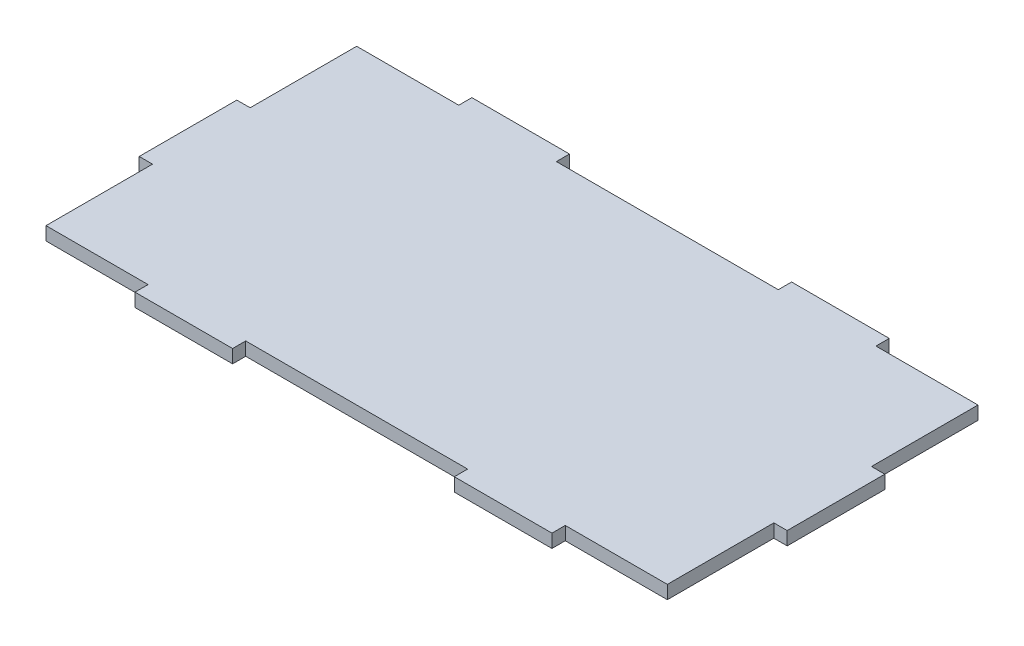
ISO-10303-21;
HEADER;
FILE_DESCRIPTION(('STEP AP214'),'2;1');
FILE_NAME('part.step','',(''),(''),'','','');
FILE_SCHEMA(('AUTOMOTIVE_DESIGN { 1 0 10303 214 1 1 1 1 }'));
ENDSEC;
DATA;
#1=APPLICATION_CONTEXT('core data for automotive mechanical design processes');
#2=APPLICATION_PROTOCOL_DEFINITION('international standard','automotive_design',2000,#1);
#3=PRODUCT_CONTEXT('',#1,'mechanical');
#4=PRODUCT('Part','Part','',(#3));
#5=PRODUCT_RELATED_PRODUCT_CATEGORY('part','',(#4));
#6=PRODUCT_DEFINITION_FORMATION('','',#4);
#7=PRODUCT_DEFINITION_CONTEXT('part definition',#1,'design');
#8=PRODUCT_DEFINITION('design','',#6,#7);
#9=PRODUCT_DEFINITION_SHAPE('','',#8);
#10=(LENGTH_UNIT() NAMED_UNIT(*) SI_UNIT(.MILLI.,.METRE.));
#11=(NAMED_UNIT(*) PLANE_ANGLE_UNIT() SI_UNIT($,.RADIAN.));
#12=(NAMED_UNIT(*) SI_UNIT($,.STERADIAN.) SOLID_ANGLE_UNIT());
#13=UNCERTAINTY_MEASURE_WITH_UNIT(LENGTH_MEASURE(1.E-05),#10,'distance_accuracy_value','');
#14=(GEOMETRIC_REPRESENTATION_CONTEXT(3) GLOBAL_UNCERTAINTY_ASSIGNED_CONTEXT((#13)) GLOBAL_UNIT_ASSIGNED_CONTEXT((#10,
#11,#12)) REPRESENTATION_CONTEXT('',''));
#15=CARTESIAN_POINT('',(0.,0.,0.));
#16=DIRECTION('',(0.,0.,1.));
#17=DIRECTION('',(1.,0.,0.));
#18=AXIS2_PLACEMENT_3D('',#15,#16,#17);
#19=CARTESIAN_POINT('',(0.,3.,-35.9354419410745));
#20=DIRECTION('',(0.,0.,-1.));
#21=DIRECTION('',(-1.,0.,0.));
#22=AXIS2_PLACEMENT_3D('',#19,#20,#21);
#23=PLANE('',#22);
#24=DIRECTION('',(1.,0.,0.));
#25=VECTOR('',#24,1.);
#26=CARTESIAN_POINT('',(0.,0.,-35.9354419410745));
#27=LINE('',#26,#25);
#28=CARTESIAN_POINT('',(-24.1954262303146,0.,-35.9354419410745));
#29=VERTEX_POINT('',#28);
#30=CARTESIAN_POINT('',(25.8045737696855,0.,-35.9354419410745));
#31=VERTEX_POINT('',#30);
#32=EDGE_CURVE('E249',#29,#31,#27,.T.);
#33=ORIENTED_EDGE('',*,*,#32,.F.);
#34=DIRECTION('',(0.,-1.,0.));
#35=VECTOR('',#34,1.);
#36=CARTESIAN_POINT('',(-24.1954262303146,3.,-35.9354419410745));
#37=LINE('',#36,#35);
#38=CARTESIAN_POINT('',(-24.1954262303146,3.,-35.9354419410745));
#39=VERTEX_POINT('',#38);
#40=EDGE_CURVE('E11',#39,#29,#37,.T.);
#41=ORIENTED_EDGE('',*,*,#40,.F.);
#42=DIRECTION('',(1.,0.,0.));
#43=VECTOR('',#42,1.);
#44=CARTESIAN_POINT('',(0.,3.,-35.9354419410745));
#45=LINE('',#44,#43);
#46=CARTESIAN_POINT('',(25.8045737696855,3.,-35.9354419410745));
#47=VERTEX_POINT('',#46);
#48=EDGE_CURVE('E322',#39,#47,#45,.T.);
#49=ORIENTED_EDGE('',*,*,#48,.T.);
#50=DIRECTION('',(0.,-1.,0.));
#51=VECTOR('',#50,1.);
#52=CARTESIAN_POINT('',(25.8045737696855,3.,-35.9354419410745));
#53=LINE('',#52,#51);
#54=EDGE_CURVE('E51',#47,#31,#53,.T.);
#55=ORIENTED_EDGE('',*,*,#54,.T.);
#56=EDGE_LOOP('',(#33,#41,#49,#55));
#57=FACE_BOUND('',#56,.T.);
#58=ADVANCED_FACE('F35',(#57),#23,.T.);
#59=CARTESIAN_POINT('',(-24.1954262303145,3.,0.));
#60=DIRECTION('',(-1.,0.,0.));
#61=DIRECTION('',(0.,0.,1.));
#62=AXIS2_PLACEMENT_3D('',#59,#60,#61);
#63=PLANE('',#62);
#64=DIRECTION('',(0.,0.,-1.));
#65=VECTOR('',#64,1.);
#66=CARTESIAN_POINT('',(-24.1954262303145,0.,0.));
#67=LINE('',#66,#65);
#68=CARTESIAN_POINT('',(-24.1954262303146,0.,-38.8906545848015));
#69=VERTEX_POINT('',#68);
#70=EDGE_CURVE('E251',#29,#69,#67,.T.);
#71=ORIENTED_EDGE('',*,*,#70,.T.);
#72=DIRECTION('',(0.,-1.,0.));
#73=VECTOR('',#72,1.);
#74=CARTESIAN_POINT('',(-24.1954262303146,3.,-38.8906545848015));
#75=LINE('',#74,#73);
#76=CARTESIAN_POINT('',(-24.1954262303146,3.,-38.8906545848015));
#77=VERTEX_POINT('',#76);
#78=EDGE_CURVE('E43',#77,#69,#75,.T.);
#79=ORIENTED_EDGE('',*,*,#78,.F.);
#80=DIRECTION('',(0.,0.,-1.));
#81=VECTOR('',#80,1.);
#82=CARTESIAN_POINT('',(-24.1954262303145,3.,0.));
#83=LINE('',#82,#81);
#84=EDGE_CURVE('E398',#39,#77,#83,.T.);
#85=ORIENTED_EDGE('',*,*,#84,.F.);
#86=ORIENTED_EDGE('',*,*,#40,.T.);
#87=EDGE_LOOP('',(#71,#79,#85,#86));
#88=FACE_BOUND('',#87,.T.);
#89=ADVANCED_FACE('F385',(#88),#63,.F.);
#90=CARTESIAN_POINT('',(0.,3.,-38.8906545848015));
#91=DIRECTION('',(0.,0.,-1.));
#92=DIRECTION('',(-1.,0.,0.));
#93=AXIS2_PLACEMENT_3D('',#90,#91,#92);
#94=PLANE('',#93);
#95=DIRECTION('',(1.,0.,0.));
#96=VECTOR('',#95,1.);
#97=CARTESIAN_POINT('',(0.,0.,-38.8906545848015));
#98=LINE('',#97,#96);
#99=CARTESIAN_POINT('',(-46.1954262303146,0.,-38.8906545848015));
#100=VERTEX_POINT('',#99);
#101=EDGE_CURVE('E254',#100,#69,#98,.T.);
#102=ORIENTED_EDGE('',*,*,#101,.F.);
#103=DIRECTION('',(0.,-1.,0.));
#104=VECTOR('',#103,1.);
#105=CARTESIAN_POINT('',(-46.1954262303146,3.,-38.8906545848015));
#106=LINE('',#105,#104);
#107=CARTESIAN_POINT('',(-46.1954262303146,3.,-38.8906545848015));
#108=VERTEX_POINT('',#107);
#109=EDGE_CURVE('E375',#108,#100,#106,.T.);
#110=ORIENTED_EDGE('',*,*,#109,.F.);
#111=DIRECTION('',(1.,0.,0.));
#112=VECTOR('',#111,1.);
#113=CARTESIAN_POINT('',(0.,3.,-38.8906545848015));
#114=LINE('',#113,#112);
#115=EDGE_CURVE('E382',#108,#77,#114,.T.);
#116=ORIENTED_EDGE('',*,*,#115,.T.);
#117=ORIENTED_EDGE('',*,*,#78,.T.);
#118=EDGE_LOOP('',(#102,#110,#116,#117));
#119=FACE_BOUND('',#118,.T.);
#120=ADVANCED_FACE('F380',(#119),#94,.T.);
#121=CARTESIAN_POINT('',(-46.1954262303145,3.,1.06848387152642E-13));
#122=DIRECTION('',(-1.,0.,0.));
#123=DIRECTION('',(0.,0.,1.));
#124=AXIS2_PLACEMENT_3D('',#121,#122,#123);
#125=PLANE('',#124);
#126=DIRECTION('',(0.,0.,-1.));
#127=VECTOR('',#126,1.);
#128=CARTESIAN_POINT('',(-46.1954262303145,0.,1.06848387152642E-13));
#129=LINE('',#128,#127);
#130=CARTESIAN_POINT('',(-46.1954262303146,0.,-35.9354419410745));
#131=VERTEX_POINT('',#130);
#132=EDGE_CURVE('E257',#131,#100,#129,.T.);
#133=ORIENTED_EDGE('',*,*,#132,.F.);
#134=DIRECTION('',(0.,-1.,0.));
#135=VECTOR('',#134,1.);
#136=CARTESIAN_POINT('',(-46.1954262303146,3.,-35.9354419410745));
#137=LINE('',#136,#135);
#138=CARTESIAN_POINT('',(-46.1954262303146,3.,-35.9354419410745));
#139=VERTEX_POINT('',#138);
#140=EDGE_CURVE('E373',#139,#131,#137,.T.);
#141=ORIENTED_EDGE('',*,*,#140,.F.);
#142=DIRECTION('',(0.,0.,-1.));
#143=VECTOR('',#142,1.);
#144=CARTESIAN_POINT('',(-46.1954262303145,3.,1.06848387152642E-13));
#145=LINE('',#144,#143);
#146=EDGE_CURVE('E395',#139,#108,#145,.T.);
#147=ORIENTED_EDGE('',*,*,#146,.T.);
#148=ORIENTED_EDGE('',*,*,#109,.T.);
#149=EDGE_LOOP('',(#133,#141,#147,#148));
#150=FACE_BOUND('',#149,.T.);
#151=ADVANCED_FACE('F392',(#150),#125,.T.);
#152=CARTESIAN_POINT('',(0.,3.,-35.9354419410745));
#153=DIRECTION('',(0.,0.,-1.));
#154=DIRECTION('',(-1.,0.,0.));
#155=AXIS2_PLACEMENT_3D('',#152,#153,#154);
#156=PLANE('',#155);
#157=DIRECTION('',(1.,0.,0.));
#158=VECTOR('',#157,1.);
#159=CARTESIAN_POINT('',(0.,0.,-35.9354419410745));
#160=LINE('',#159,#158);
#161=CARTESIAN_POINT('',(-69.1954262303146,0.,-35.9354419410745));
#162=VERTEX_POINT('',#161);
#163=EDGE_CURVE('E260',#162,#131,#160,.T.);
#164=ORIENTED_EDGE('',*,*,#163,.F.);
#165=DIRECTION('',(0.,-1.,0.));
#166=VECTOR('',#165,1.);
#167=CARTESIAN_POINT('',(-69.1954262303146,3.,-35.9354419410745));
#168=LINE('',#167,#166);
#169=CARTESIAN_POINT('',(-69.1954262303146,3.,-35.9354419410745));
#170=VERTEX_POINT('',#169);
#171=EDGE_CURVE('E371',#170,#162,#168,.T.);
#172=ORIENTED_EDGE('',*,*,#171,.F.);
#173=DIRECTION('',(1.,0.,0.));
#174=VECTOR('',#173,1.);
#175=CARTESIAN_POINT('',(0.,3.,-35.9354419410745));
#176=LINE('',#175,#174);
#177=EDGE_CURVE('E400',#170,#139,#176,.T.);
#178=ORIENTED_EDGE('',*,*,#177,.T.);
#179=ORIENTED_EDGE('',*,*,#140,.T.);
#180=EDGE_LOOP('',(#164,#172,#178,#179));
#181=FACE_BOUND('',#180,.T.);
#182=ADVANCED_FACE('F475',(#181),#156,.T.);
#183=CARTESIAN_POINT('',(-69.1954262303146,3.,0.));
#184=DIRECTION('',(1.,0.,0.));
#185=DIRECTION('',(0.,0.,-1.));
#186=AXIS2_PLACEMENT_3D('',#183,#184,#185);
#187=PLANE('',#186);
#188=DIRECTION('',(0.,0.,1.));
#189=VECTOR('',#188,1.);
#190=CARTESIAN_POINT('',(-69.1954262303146,0.,0.));
#191=LINE('',#190,#189);
#192=CARTESIAN_POINT('',(-69.1954262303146,0.,-11.9354419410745));
#193=VERTEX_POINT('',#192);
#194=EDGE_CURVE('E263',#162,#193,#191,.T.);
#195=ORIENTED_EDGE('',*,*,#194,.T.);
#196=DIRECTION('',(0.,-1.,0.));
#197=VECTOR('',#196,1.);
#198=CARTESIAN_POINT('',(-69.1954262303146,3.,-11.9354419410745));
#199=LINE('',#198,#197);
#200=CARTESIAN_POINT('',(-69.1954262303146,3.,-11.9354419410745));
#201=VERTEX_POINT('',#200);
#202=EDGE_CURVE('E368',#201,#193,#199,.T.);
#203=ORIENTED_EDGE('',*,*,#202,.F.);
#204=DIRECTION('',(0.,0.,1.));
#205=VECTOR('',#204,1.);
#206=CARTESIAN_POINT('',(-69.1954262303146,3.,0.));
#207=LINE('',#206,#205);
#208=EDGE_CURVE('E406',#170,#201,#207,.T.);
#209=ORIENTED_EDGE('',*,*,#208,.F.);
#210=ORIENTED_EDGE('',*,*,#171,.T.);
#211=EDGE_LOOP('',(#195,#203,#209,#210));
#212=FACE_BOUND('',#211,.T.);
#213=ADVANCED_FACE('F478',(#212),#187,.F.);
#214=CARTESIAN_POINT('',(0.,3.,-11.9354419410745));
#215=DIRECTION('',(0.,0.,1.));
#216=DIRECTION('',(1.,0.,0.));
#217=AXIS2_PLACEMENT_3D('',#214,#215,#216);
#218=PLANE('',#217);
#219=DIRECTION('',(-1.,0.,0.));
#220=VECTOR('',#219,1.);
#221=CARTESIAN_POINT('',(0.,0.,-11.9354419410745));
#222=LINE('',#221,#220);
#223=CARTESIAN_POINT('',(-72.1954262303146,0.,-11.9354419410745));
#224=VERTEX_POINT('',#223);
#225=EDGE_CURVE('E265',#193,#224,#222,.T.);
#226=ORIENTED_EDGE('',*,*,#225,.T.);
#227=DIRECTION('',(0.,-1.,0.));
#228=VECTOR('',#227,1.);
#229=CARTESIAN_POINT('',(-72.1954262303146,3.,-11.9354419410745));
#230=LINE('',#229,#228);
#231=CARTESIAN_POINT('',(-72.1954262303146,3.,-11.9354419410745));
#232=VERTEX_POINT('',#231);
#233=EDGE_CURVE('E365',#232,#224,#230,.T.);
#234=ORIENTED_EDGE('',*,*,#233,.F.);
#235=DIRECTION('',(-1.,0.,0.));
#236=VECTOR('',#235,1.);
#237=CARTESIAN_POINT('',(0.,3.,-11.9354419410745));
#238=LINE('',#237,#236);
#239=EDGE_CURVE('E408',#201,#232,#238,.T.);
#240=ORIENTED_EDGE('',*,*,#239,.F.);
#241=ORIENTED_EDGE('',*,*,#202,.T.);
#242=EDGE_LOOP('',(#226,#234,#240,#241));
#243=FACE_BOUND('',#242,.T.);
#244=ADVANCED_FACE('F482',(#243),#218,.F.);
#245=CARTESIAN_POINT('',(-72.1954262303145,3.,0.));
#246=DIRECTION('',(1.,0.,0.));
#247=DIRECTION('',(0.,0.,-1.));
#248=AXIS2_PLACEMENT_3D('',#245,#246,#247);
#249=PLANE('',#248);
#250=DIRECTION('',(0.,0.,1.));
#251=VECTOR('',#250,1.);
#252=CARTESIAN_POINT('',(-72.1954262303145,0.,0.));
#253=LINE('',#252,#251);
#254=CARTESIAN_POINT('',(-72.1954262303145,0.,10.0645580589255));
#255=VERTEX_POINT('',#254);
#256=EDGE_CURVE('E267',#224,#255,#253,.T.);
#257=ORIENTED_EDGE('',*,*,#256,.T.);
#258=DIRECTION('',(0.,-1.,0.));
#259=VECTOR('',#258,1.);
#260=CARTESIAN_POINT('',(-72.1954262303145,3.,10.0645580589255));
#261=LINE('',#260,#259);
#262=CARTESIAN_POINT('',(-72.1954262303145,3.,10.0645580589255));
#263=VERTEX_POINT('',#262);
#264=EDGE_CURVE('E363',#263,#255,#261,.T.);
#265=ORIENTED_EDGE('',*,*,#264,.F.);
#266=DIRECTION('',(0.,0.,1.));
#267=VECTOR('',#266,1.);
#268=CARTESIAN_POINT('',(-72.1954262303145,3.,0.));
#269=LINE('',#268,#267);
#270=EDGE_CURVE('E410',#232,#263,#269,.T.);
#271=ORIENTED_EDGE('',*,*,#270,.F.);
#272=ORIENTED_EDGE('',*,*,#233,.T.);
#273=EDGE_LOOP('',(#257,#265,#271,#272));
#274=FACE_BOUND('',#273,.T.);
#275=ADVANCED_FACE('F486',(#274),#249,.F.);
#276=CARTESIAN_POINT('',(0.,3.,10.0645580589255));
#277=DIRECTION('',(0.,0.,1.));
#278=DIRECTION('',(1.,0.,0.));
#279=AXIS2_PLACEMENT_3D('',#276,#277,#278);
#280=PLANE('',#279);
#281=DIRECTION('',(-1.,0.,0.));
#282=VECTOR('',#281,1.);
#283=CARTESIAN_POINT('',(0.,0.,10.0645580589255));
#284=LINE('',#283,#282);
#285=CARTESIAN_POINT('',(-69.1954262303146,0.,10.0645580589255));
#286=VERTEX_POINT('',#285);
#287=EDGE_CURVE('E270',#286,#255,#284,.T.);
#288=ORIENTED_EDGE('',*,*,#287,.F.);
#289=DIRECTION('',(0.,-1.,0.));
#290=VECTOR('',#289,1.);
#291=CARTESIAN_POINT('',(-69.1954262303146,3.,10.0645580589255));
#292=LINE('',#291,#290);
#293=CARTESIAN_POINT('',(-69.1954262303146,3.,10.0645580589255));
#294=VERTEX_POINT('',#293);
#295=EDGE_CURVE('E361',#294,#286,#292,.T.);
#296=ORIENTED_EDGE('',*,*,#295,.F.);
#297=DIRECTION('',(-1.,0.,0.));
#298=VECTOR('',#297,1.);
#299=CARTESIAN_POINT('',(0.,3.,10.0645580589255));
#300=LINE('',#299,#298);
#301=EDGE_CURVE('E412',#294,#263,#300,.T.);
#302=ORIENTED_EDGE('',*,*,#301,.T.);
#303=ORIENTED_EDGE('',*,*,#264,.T.);
#304=EDGE_LOOP('',(#288,#296,#302,#303));
#305=FACE_BOUND('',#304,.T.);
#306=ADVANCED_FACE('F490',(#305),#280,.T.);
#307=CARTESIAN_POINT('',(-69.1954262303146,3.,0.));
#308=DIRECTION('',(1.,0.,0.));
#309=DIRECTION('',(0.,0.,-1.));
#310=AXIS2_PLACEMENT_3D('',#307,#308,#309);
#311=PLANE('',#310);
#312=DIRECTION('',(0.,0.,1.));
#313=VECTOR('',#312,1.);
#314=CARTESIAN_POINT('',(-69.1954262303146,0.,0.));
#315=LINE('',#314,#313);
#316=CARTESIAN_POINT('',(-69.1954262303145,0.,34.0645580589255));
#317=VERTEX_POINT('',#316);
#318=EDGE_CURVE('E273',#286,#317,#315,.T.);
#319=ORIENTED_EDGE('',*,*,#318,.T.);
#320=DIRECTION('',(0.,-1.,0.));
#321=VECTOR('',#320,1.);
#322=CARTESIAN_POINT('',(-69.1954262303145,3.,34.0645580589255));
#323=LINE('',#322,#321);
#324=CARTESIAN_POINT('',(-69.1954262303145,3.,34.0645580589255));
#325=VERTEX_POINT('',#324);
#326=EDGE_CURVE('E358',#325,#317,#323,.T.);
#327=ORIENTED_EDGE('',*,*,#326,.F.);
#328=DIRECTION('',(0.,0.,1.));
#329=VECTOR('',#328,1.);
#330=CARTESIAN_POINT('',(-69.1954262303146,3.,0.));
#331=LINE('',#330,#329);
#332=EDGE_CURVE('E415',#294,#325,#331,.T.);
#333=ORIENTED_EDGE('',*,*,#332,.F.);
#334=ORIENTED_EDGE('',*,*,#295,.T.);
#335=EDGE_LOOP('',(#319,#327,#333,#334));
#336=FACE_BOUND('',#335,.T.);
#337=ADVANCED_FACE('F494',(#336),#311,.F.);
#338=CARTESIAN_POINT('',(0.,3.,34.0645580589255));
#339=DIRECTION('',(0.,0.,-1.));
#340=DIRECTION('',(-1.,0.,0.));
#341=AXIS2_PLACEMENT_3D('',#338,#339,#340);
#342=PLANE('',#341);
#343=DIRECTION('',(1.,0.,0.));
#344=VECTOR('',#343,1.);
#345=CARTESIAN_POINT('',(0.,0.,34.0645580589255));
#346=LINE('',#345,#344);
#347=CARTESIAN_POINT('',(-46.1954262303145,0.,34.0645580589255));
#348=VERTEX_POINT('',#347);
#349=EDGE_CURVE('E275',#317,#348,#346,.T.);
#350=ORIENTED_EDGE('',*,*,#349,.T.);
#351=DIRECTION('',(0.,-1.,0.));
#352=VECTOR('',#351,1.);
#353=CARTESIAN_POINT('',(-46.1954262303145,3.,34.0645580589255));
#354=LINE('',#353,#352);
#355=CARTESIAN_POINT('',(-46.1954262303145,3.,34.0645580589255));
#356=VERTEX_POINT('',#355);
#357=EDGE_CURVE('E355',#356,#348,#354,.T.);
#358=ORIENTED_EDGE('',*,*,#357,.F.);
#359=DIRECTION('',(1.,0.,0.));
#360=VECTOR('',#359,1.);
#361=CARTESIAN_POINT('',(0.,3.,34.0645580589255));
#362=LINE('',#361,#360);
#363=EDGE_CURVE('E417',#325,#356,#362,.T.);
#364=ORIENTED_EDGE('',*,*,#363,.F.);
#365=ORIENTED_EDGE('',*,*,#326,.T.);
#366=EDGE_LOOP('',(#350,#358,#364,#365));
#367=FACE_BOUND('',#366,.T.);
#368=ADVANCED_FACE('F498',(#367),#342,.F.);
#369=CARTESIAN_POINT('',(-46.1954262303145,3.,-1.06848387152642E-13));
#370=DIRECTION('',(1.,0.,0.));
#371=DIRECTION('',(0.,0.,-1.));
#372=AXIS2_PLACEMENT_3D('',#369,#370,#371);
#373=PLANE('',#372);
#374=DIRECTION('',(0.,0.,1.));
#375=VECTOR('',#374,1.);
#376=CARTESIAN_POINT('',(-46.1954262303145,0.,-1.06848387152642E-13));
#377=LINE('',#376,#375);
#378=CARTESIAN_POINT('',(-46.1954262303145,0.,37.0197707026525));
#379=VERTEX_POINT('',#378);
#380=EDGE_CURVE('E277',#348,#379,#377,.T.);
#381=ORIENTED_EDGE('',*,*,#380,.T.);
#382=DIRECTION('',(0.,-1.,0.));
#383=VECTOR('',#382,1.);
#384=CARTESIAN_POINT('',(-46.1954262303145,3.,37.0197707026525));
#385=LINE('',#384,#383);
#386=CARTESIAN_POINT('',(-46.1954262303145,3.,37.0197707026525));
#387=VERTEX_POINT('',#386);
#388=EDGE_CURVE('E352',#387,#379,#385,.T.);
#389=ORIENTED_EDGE('',*,*,#388,.F.);
#390=DIRECTION('',(0.,0.,1.));
#391=VECTOR('',#390,1.);
#392=CARTESIAN_POINT('',(-46.1954262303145,3.,-1.06848387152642E-13));
#393=LINE('',#392,#391);
#394=EDGE_CURVE('E419',#356,#387,#393,.T.);
#395=ORIENTED_EDGE('',*,*,#394,.F.);
#396=ORIENTED_EDGE('',*,*,#357,.T.);
#397=EDGE_LOOP('',(#381,#389,#395,#396));
#398=FACE_BOUND('',#397,.T.);
#399=ADVANCED_FACE('F502',(#398),#373,.F.);
#400=CARTESIAN_POINT('',(0.,3.,37.0197707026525));
#401=DIRECTION('',(0.,0.,-1.));
#402=DIRECTION('',(-1.,0.,0.));
#403=AXIS2_PLACEMENT_3D('',#400,#401,#402);
#404=PLANE('',#403);
#405=DIRECTION('',(1.,0.,0.));
#406=VECTOR('',#405,1.);
#407=CARTESIAN_POINT('',(0.,0.,37.0197707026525));
#408=LINE('',#407,#406);
#409=CARTESIAN_POINT('',(-24.1954262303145,0.,37.0197707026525));
#410=VERTEX_POINT('',#409);
#411=EDGE_CURVE('E279',#379,#410,#408,.T.);
#412=ORIENTED_EDGE('',*,*,#411,.T.);
#413=DIRECTION('',(0.,-1.,0.));
#414=VECTOR('',#413,1.);
#415=CARTESIAN_POINT('',(-24.1954262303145,3.,37.0197707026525));
#416=LINE('',#415,#414);
#417=CARTESIAN_POINT('',(-24.1954262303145,3.,37.0197707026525));
#418=VERTEX_POINT('',#417);
#419=EDGE_CURVE('E350',#418,#410,#416,.T.);
#420=ORIENTED_EDGE('',*,*,#419,.F.);
#421=DIRECTION('',(1.,0.,0.));
#422=VECTOR('',#421,1.);
#423=CARTESIAN_POINT('',(0.,3.,37.0197707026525));
#424=LINE('',#423,#422);
#425=EDGE_CURVE('E421',#387,#418,#424,.T.);
#426=ORIENTED_EDGE('',*,*,#425,.F.);
#427=ORIENTED_EDGE('',*,*,#388,.T.);
#428=EDGE_LOOP('',(#412,#420,#426,#427));
#429=FACE_BOUND('',#428,.T.);
#430=ADVANCED_FACE('F506',(#429),#404,.F.);
#431=CARTESIAN_POINT('',(-24.1954262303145,3.,0.));
#432=DIRECTION('',(1.,0.,0.));
#433=DIRECTION('',(0.,0.,-1.));
#434=AXIS2_PLACEMENT_3D('',#431,#432,#433);
#435=PLANE('',#434);
#436=DIRECTION('',(0.,0.,1.));
#437=VECTOR('',#436,1.);
#438=CARTESIAN_POINT('',(-24.1954262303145,0.,0.));
#439=LINE('',#438,#437);
#440=CARTESIAN_POINT('',(-24.1954262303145,0.,34.0645580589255));
#441=VERTEX_POINT('',#440);
#442=EDGE_CURVE('E282',#441,#410,#439,.T.);
#443=ORIENTED_EDGE('',*,*,#442,.F.);
#444=DIRECTION('',(0.,-1.,0.));
#445=VECTOR('',#444,1.);
#446=CARTESIAN_POINT('',(-24.1954262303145,3.,34.0645580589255));
#447=LINE('',#446,#445);
#448=CARTESIAN_POINT('',(-24.1954262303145,3.,34.0645580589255));
#449=VERTEX_POINT('',#448);
#450=EDGE_CURVE('E348',#449,#441,#447,.T.);
#451=ORIENTED_EDGE('',*,*,#450,.F.);
#452=DIRECTION('',(0.,0.,1.));
#453=VECTOR('',#452,1.);
#454=CARTESIAN_POINT('',(-24.1954262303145,3.,0.));
#455=LINE('',#454,#453);
#456=EDGE_CURVE('E423',#449,#418,#455,.T.);
#457=ORIENTED_EDGE('',*,*,#456,.T.);
#458=ORIENTED_EDGE('',*,*,#419,.T.);
#459=EDGE_LOOP('',(#443,#451,#457,#458));
#460=FACE_BOUND('',#459,.T.);
#461=ADVANCED_FACE('F510',(#460),#435,.T.);
#462=CARTESIAN_POINT('',(0.,3.,34.0645580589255));
#463=DIRECTION('',(0.,0.,-1.));
#464=DIRECTION('',(-1.,0.,0.));
#465=AXIS2_PLACEMENT_3D('',#462,#463,#464);
#466=PLANE('',#465);
#467=DIRECTION('',(1.,0.,0.));
#468=VECTOR('',#467,1.);
#469=CARTESIAN_POINT('',(0.,0.,34.0645580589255));
#470=LINE('',#469,#468);
#471=CARTESIAN_POINT('',(25.8045737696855,0.,34.0645580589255));
#472=VERTEX_POINT('',#471);
#473=EDGE_CURVE('E285',#441,#472,#470,.T.);
#474=ORIENTED_EDGE('',*,*,#473,.T.);
#475=DIRECTION('',(0.,-1.,0.));
#476=VECTOR('',#475,1.);
#477=CARTESIAN_POINT('',(25.8045737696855,3.,34.0645580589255));
#478=LINE('',#477,#476);
#479=CARTESIAN_POINT('',(25.8045737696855,3.,34.0645580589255));
#480=VERTEX_POINT('',#479);
#481=EDGE_CURVE('E345',#480,#472,#478,.T.);
#482=ORIENTED_EDGE('',*,*,#481,.F.);
#483=DIRECTION('',(1.,0.,0.));
#484=VECTOR('',#483,1.);
#485=CARTESIAN_POINT('',(0.,3.,34.0645580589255));
#486=LINE('',#485,#484);
#487=EDGE_CURVE('E426',#449,#480,#486,.T.);
#488=ORIENTED_EDGE('',*,*,#487,.F.);
#489=ORIENTED_EDGE('',*,*,#450,.T.);
#490=EDGE_LOOP('',(#474,#482,#488,#489));
#491=FACE_BOUND('',#490,.T.);
#492=ADVANCED_FACE('F514',(#491),#466,.F.);
#493=CARTESIAN_POINT('',(25.8045737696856,3.,1.19370133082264E-13));
#494=DIRECTION('',(1.,0.,0.));
#495=DIRECTION('',(0.,0.,-1.));
#496=AXIS2_PLACEMENT_3D('',#493,#494,#495);
#497=PLANE('',#496);
#498=DIRECTION('',(0.,0.,1.));
#499=VECTOR('',#498,1.);
#500=CARTESIAN_POINT('',(25.8045737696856,0.,1.19370133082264E-13));
#501=LINE('',#500,#499);
#502=CARTESIAN_POINT('',(25.8045737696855,0.,37.0645580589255));
#503=VERTEX_POINT('',#502);
#504=EDGE_CURVE('E287',#472,#503,#501,.T.);
#505=ORIENTED_EDGE('',*,*,#504,.T.);
#506=DIRECTION('',(0.,-1.,0.));
#507=VECTOR('',#506,1.);
#508=CARTESIAN_POINT('',(25.8045737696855,3.,37.0645580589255));
#509=LINE('',#508,#507);
#510=CARTESIAN_POINT('',(25.8045737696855,3.,37.0645580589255));
#511=VERTEX_POINT('',#510);
#512=EDGE_CURVE('E342',#511,#503,#509,.T.);
#513=ORIENTED_EDGE('',*,*,#512,.F.);
#514=DIRECTION('',(0.,0.,1.));
#515=VECTOR('',#514,1.);
#516=CARTESIAN_POINT('',(25.8045737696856,3.,1.19370133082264E-13));
#517=LINE('',#516,#515);
#518=EDGE_CURVE('E428',#480,#511,#517,.T.);
#519=ORIENTED_EDGE('',*,*,#518,.F.);
#520=ORIENTED_EDGE('',*,*,#481,.T.);
#521=EDGE_LOOP('',(#505,#513,#519,#520));
#522=FACE_BOUND('',#521,.T.);
#523=ADVANCED_FACE('F518',(#522),#497,.F.);
#524=CARTESIAN_POINT('',(0.,3.,37.0645580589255));
#525=DIRECTION('',(0.,0.,-1.));
#526=DIRECTION('',(-1.,0.,0.));
#527=AXIS2_PLACEMENT_3D('',#524,#525,#526);
#528=PLANE('',#527);
#529=DIRECTION('',(1.,0.,0.));
#530=VECTOR('',#529,1.);
#531=CARTESIAN_POINT('',(0.,0.,37.0645580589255));
#532=LINE('',#531,#530);
#533=CARTESIAN_POINT('',(47.8045737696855,0.,37.0645580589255));
#534=VERTEX_POINT('',#533);
#535=EDGE_CURVE('E289',#503,#534,#532,.T.);
#536=ORIENTED_EDGE('',*,*,#535,.T.);
#537=DIRECTION('',(0.,-1.,0.));
#538=VECTOR('',#537,1.);
#539=CARTESIAN_POINT('',(47.8045737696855,3.,37.0645580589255));
#540=LINE('',#539,#538);
#541=CARTESIAN_POINT('',(47.8045737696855,3.,37.0645580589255));
#542=VERTEX_POINT('',#541);
#543=EDGE_CURVE('E340',#542,#534,#540,.T.);
#544=ORIENTED_EDGE('',*,*,#543,.F.);
#545=DIRECTION('',(1.,0.,0.));
#546=VECTOR('',#545,1.);
#547=CARTESIAN_POINT('',(0.,3.,37.0645580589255));
#548=LINE('',#547,#546);
#549=EDGE_CURVE('E430',#511,#542,#548,.T.);
#550=ORIENTED_EDGE('',*,*,#549,.F.);
#551=ORIENTED_EDGE('',*,*,#512,.T.);
#552=EDGE_LOOP('',(#536,#544,#550,#551));
#553=FACE_BOUND('',#552,.T.);
#554=ADVANCED_FACE('F522',(#553),#528,.F.);
#555=CARTESIAN_POINT('',(47.8045737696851,3.,-4.42281154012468E-13));
#556=DIRECTION('',(1.,0.,0.));
#557=DIRECTION('',(0.,0.,-1.));
#558=AXIS2_PLACEMENT_3D('',#555,#556,#557);
#559=PLANE('',#558);
#560=DIRECTION('',(0.,0.,1.));
#561=VECTOR('',#560,1.);
#562=CARTESIAN_POINT('',(47.8045737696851,0.,-4.42281154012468E-13));
#563=LINE('',#562,#561);
#564=CARTESIAN_POINT('',(47.8045737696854,0.,34.0645580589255));
#565=VERTEX_POINT('',#564);
#566=EDGE_CURVE('E292',#565,#534,#563,.T.);
#567=ORIENTED_EDGE('',*,*,#566,.F.);
#568=DIRECTION('',(0.,-1.,0.));
#569=VECTOR('',#568,1.);
#570=CARTESIAN_POINT('',(47.8045737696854,3.,34.0645580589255));
#571=LINE('',#570,#569);
#572=CARTESIAN_POINT('',(47.8045737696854,3.,34.0645580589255));
#573=VERTEX_POINT('',#572);
#574=EDGE_CURVE('E338',#573,#565,#571,.T.);
#575=ORIENTED_EDGE('',*,*,#574,.F.);
#576=DIRECTION('',(0.,0.,1.));
#577=VECTOR('',#576,1.);
#578=CARTESIAN_POINT('',(47.8045737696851,3.,-4.42281154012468E-13));
#579=LINE('',#578,#577);
#580=EDGE_CURVE('E432',#573,#542,#579,.T.);
#581=ORIENTED_EDGE('',*,*,#580,.T.);
#582=ORIENTED_EDGE('',*,*,#543,.T.);
#583=EDGE_LOOP('',(#567,#575,#581,#582));
#584=FACE_BOUND('',#583,.T.);
#585=ADVANCED_FACE('F526',(#584),#559,.T.);
#586=CARTESIAN_POINT('',(0.,3.,34.0645580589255));
#587=DIRECTION('',(0.,0.,-1.));
#588=DIRECTION('',(-1.,0.,0.));
#589=AXIS2_PLACEMENT_3D('',#586,#587,#588);
#590=PLANE('',#589);
#591=DIRECTION('',(1.,0.,0.));
#592=VECTOR('',#591,1.);
#593=CARTESIAN_POINT('',(0.,0.,34.0645580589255));
#594=LINE('',#593,#592);
#595=CARTESIAN_POINT('',(70.8045737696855,0.,34.0645580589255));
#596=VERTEX_POINT('',#595);
#597=EDGE_CURVE('E295',#565,#596,#594,.T.);
#598=ORIENTED_EDGE('',*,*,#597,.T.);
#599=DIRECTION('',(0.,-1.,0.));
#600=VECTOR('',#599,1.);
#601=CARTESIAN_POINT('',(70.8045737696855,3.,34.0645580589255));
#602=LINE('',#601,#600);
#603=CARTESIAN_POINT('',(70.8045737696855,3.,34.0645580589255));
#604=VERTEX_POINT('',#603);
#605=EDGE_CURVE('E336',#604,#596,#602,.T.);
#606=ORIENTED_EDGE('',*,*,#605,.F.);
#607=DIRECTION('',(1.,0.,0.));
#608=VECTOR('',#607,1.);
#609=CARTESIAN_POINT('',(0.,3.,34.0645580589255));
#610=LINE('',#609,#608);
#611=EDGE_CURVE('E435',#573,#604,#610,.T.);
#612=ORIENTED_EDGE('',*,*,#611,.F.);
#613=ORIENTED_EDGE('',*,*,#574,.T.);
#614=EDGE_LOOP('',(#598,#606,#612,#613));
#615=FACE_BOUND('',#614,.T.);
#616=ADVANCED_FACE('F530',(#615),#590,.F.);
#617=CARTESIAN_POINT('',(70.8045737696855,3.,0.));
#618=DIRECTION('',(1.,0.,0.));
#619=DIRECTION('',(0.,0.,-1.));
#620=AXIS2_PLACEMENT_3D('',#617,#618,#619);
#621=PLANE('',#620);
#622=DIRECTION('',(0.,0.,1.));
#623=VECTOR('',#622,1.);
#624=CARTESIAN_POINT('',(70.8045737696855,0.,0.));
#625=LINE('',#624,#623);
#626=CARTESIAN_POINT('',(70.8045737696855,0.,10.0645580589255));
#627=VERTEX_POINT('',#626);
#628=EDGE_CURVE('E298',#627,#596,#625,.T.);
#629=ORIENTED_EDGE('',*,*,#628,.F.);
#630=DIRECTION('',(0.,-1.,0.));
#631=VECTOR('',#630,1.);
#632=CARTESIAN_POINT('',(70.8045737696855,3.,10.0645580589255));
#633=LINE('',#632,#631);
#634=CARTESIAN_POINT('',(70.8045737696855,3.,10.0645580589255));
#635=VERTEX_POINT('',#634);
#636=EDGE_CURVE('E334',#635,#627,#633,.T.);
#637=ORIENTED_EDGE('',*,*,#636,.F.);
#638=DIRECTION('',(0.,0.,1.));
#639=VECTOR('',#638,1.);
#640=CARTESIAN_POINT('',(70.8045737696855,3.,0.));
#641=LINE('',#640,#639);
#642=EDGE_CURVE('E437',#635,#604,#641,.T.);
#643=ORIENTED_EDGE('',*,*,#642,.T.);
#644=ORIENTED_EDGE('',*,*,#605,.T.);
#645=EDGE_LOOP('',(#629,#637,#643,#644));
#646=FACE_BOUND('',#645,.T.);
#647=ADVANCED_FACE('F534',(#646),#621,.T.);
#648=CARTESIAN_POINT('',(0.,3.,10.0645580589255));
#649=DIRECTION('',(0.,0.,-1.));
#650=DIRECTION('',(-1.,0.,0.));
#651=AXIS2_PLACEMENT_3D('',#648,#649,#650);
#652=PLANE('',#651);
#653=DIRECTION('',(1.,0.,0.));
#654=VECTOR('',#653,1.);
#655=CARTESIAN_POINT('',(0.,0.,10.0645580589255));
#656=LINE('',#655,#654);
#657=CARTESIAN_POINT('',(73.8045737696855,0.,10.0645580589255));
#658=VERTEX_POINT('',#657);
#659=EDGE_CURVE('E301',#627,#658,#656,.T.);
#660=ORIENTED_EDGE('',*,*,#659,.T.);
#661=DIRECTION('',(0.,-1.,0.));
#662=VECTOR('',#661,1.);
#663=CARTESIAN_POINT('',(73.8045737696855,3.,10.0645580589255));
#664=LINE('',#663,#662);
#665=CARTESIAN_POINT('',(73.8045737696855,3.,10.0645580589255));
#666=VERTEX_POINT('',#665);
#667=EDGE_CURVE('E332',#666,#658,#664,.T.);
#668=ORIENTED_EDGE('',*,*,#667,.F.);
#669=DIRECTION('',(1.,0.,0.));
#670=VECTOR('',#669,1.);
#671=CARTESIAN_POINT('',(0.,3.,10.0645580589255));
#672=LINE('',#671,#670);
#673=EDGE_CURVE('E440',#635,#666,#672,.T.);
#674=ORIENTED_EDGE('',*,*,#673,.F.);
#675=ORIENTED_EDGE('',*,*,#636,.T.);
#676=EDGE_LOOP('',(#660,#668,#674,#675));
#677=FACE_BOUND('',#676,.T.);
#678=ADVANCED_FACE('F538',(#677),#652,.F.);
#679=CARTESIAN_POINT('',(73.8045737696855,3.,0.));
#680=DIRECTION('',(1.,0.,0.));
#681=DIRECTION('',(0.,0.,-1.));
#682=AXIS2_PLACEMENT_3D('',#679,#680,#681);
#683=PLANE('',#682);
#684=DIRECTION('',(0.,0.,1.));
#685=VECTOR('',#684,1.);
#686=CARTESIAN_POINT('',(73.8045737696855,0.,0.));
#687=LINE('',#686,#685);
#688=CARTESIAN_POINT('',(73.8045737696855,0.,-11.9354419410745));
#689=VERTEX_POINT('',#688);
#690=EDGE_CURVE('E304',#689,#658,#687,.T.);
#691=ORIENTED_EDGE('',*,*,#690,.F.);
#692=DIRECTION('',(0.,-1.,0.));
#693=VECTOR('',#692,1.);
#694=CARTESIAN_POINT('',(73.8045737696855,3.,-11.9354419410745));
#695=LINE('',#694,#693);
#696=CARTESIAN_POINT('',(73.8045737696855,3.,-11.9354419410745));
#697=VERTEX_POINT('',#696);
#698=EDGE_CURVE('E330',#697,#689,#695,.T.);
#699=ORIENTED_EDGE('',*,*,#698,.F.);
#700=DIRECTION('',(0.,0.,1.));
#701=VECTOR('',#700,1.);
#702=CARTESIAN_POINT('',(73.8045737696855,3.,0.));
#703=LINE('',#702,#701);
#704=EDGE_CURVE('E442',#697,#666,#703,.T.);
#705=ORIENTED_EDGE('',*,*,#704,.T.);
#706=ORIENTED_EDGE('',*,*,#667,.T.);
#707=EDGE_LOOP('',(#691,#699,#705,#706));
#708=FACE_BOUND('',#707,.T.);
#709=ADVANCED_FACE('F542',(#708),#683,.T.);
#710=CARTESIAN_POINT('',(0.,3.,-11.9354419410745));
#711=DIRECTION('',(0.,0.,-1.));
#712=DIRECTION('',(-1.,0.,0.));
#713=AXIS2_PLACEMENT_3D('',#710,#711,#712);
#714=PLANE('',#713);
#715=DIRECTION('',(1.,0.,0.));
#716=VECTOR('',#715,1.);
#717=CARTESIAN_POINT('',(0.,0.,-11.9354419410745));
#718=LINE('',#717,#716);
#719=CARTESIAN_POINT('',(70.8045737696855,0.,-11.9354419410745));
#720=VERTEX_POINT('',#719);
#721=EDGE_CURVE('E307',#720,#689,#718,.T.);
#722=ORIENTED_EDGE('',*,*,#721,.F.);
#723=DIRECTION('',(0.,-1.,0.));
#724=VECTOR('',#723,1.);
#725=CARTESIAN_POINT('',(70.8045737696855,3.,-11.9354419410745));
#726=LINE('',#725,#724);
#727=CARTESIAN_POINT('',(70.8045737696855,3.,-11.9354419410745));
#728=VERTEX_POINT('',#727);
#729=EDGE_CURVE('E328',#728,#720,#726,.T.);
#730=ORIENTED_EDGE('',*,*,#729,.F.);
#731=DIRECTION('',(1.,0.,0.));
#732=VECTOR('',#731,1.);
#733=CARTESIAN_POINT('',(0.,3.,-11.9354419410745));
#734=LINE('',#733,#732);
#735=EDGE_CURVE('E445',#728,#697,#734,.T.);
#736=ORIENTED_EDGE('',*,*,#735,.T.);
#737=ORIENTED_EDGE('',*,*,#698,.T.);
#738=EDGE_LOOP('',(#722,#730,#736,#737));
#739=FACE_BOUND('',#738,.T.);
#740=ADVANCED_FACE('F546',(#739),#714,.T.);
#741=CARTESIAN_POINT('',(70.8045737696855,3.,0.));
#742=DIRECTION('',(1.,0.,0.));
#743=DIRECTION('',(0.,0.,-1.));
#744=AXIS2_PLACEMENT_3D('',#741,#742,#743);
#745=PLANE('',#744);
#746=DIRECTION('',(0.,0.,1.));
#747=VECTOR('',#746,1.);
#748=CARTESIAN_POINT('',(70.8045737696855,0.,0.));
#749=LINE('',#748,#747);
#750=CARTESIAN_POINT('',(70.8045737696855,0.,-35.9354419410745));
#751=VERTEX_POINT('',#750);
#752=EDGE_CURVE('E310',#751,#720,#749,.T.);
#753=ORIENTED_EDGE('',*,*,#752,.F.);
#754=DIRECTION('',(0.,-1.,0.));
#755=VECTOR('',#754,1.);
#756=CARTESIAN_POINT('',(70.8045737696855,3.,-35.9354419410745));
#757=LINE('',#756,#755);
#758=CARTESIAN_POINT('',(70.8045737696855,3.,-35.9354419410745));
#759=VERTEX_POINT('',#758);
#760=EDGE_CURVE('E326',#759,#751,#757,.T.);
#761=ORIENTED_EDGE('',*,*,#760,.F.);
#762=DIRECTION('',(0.,0.,1.));
#763=VECTOR('',#762,1.);
#764=CARTESIAN_POINT('',(70.8045737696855,3.,0.));
#765=LINE('',#764,#763);
#766=EDGE_CURVE('E448',#759,#728,#765,.T.);
#767=ORIENTED_EDGE('',*,*,#766,.T.);
#768=ORIENTED_EDGE('',*,*,#729,.T.);
#769=EDGE_LOOP('',(#753,#761,#767,#768));
#770=FACE_BOUND('',#769,.T.);
#771=ADVANCED_FACE('F550',(#770),#745,.T.);
#772=CARTESIAN_POINT('',(0.,3.,-35.9354419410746));
#773=DIRECTION('',(0.,0.,-1.));
#774=DIRECTION('',(-1.,0.,0.));
#775=AXIS2_PLACEMENT_3D('',#772,#773,#774);
#776=PLANE('',#775);
#777=DIRECTION('',(1.,0.,0.));
#778=VECTOR('',#777,1.);
#779=CARTESIAN_POINT('',(0.,0.,-35.9354419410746));
#780=LINE('',#779,#778);
#781=CARTESIAN_POINT('',(47.8045737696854,0.,-35.9354419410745));
#782=VERTEX_POINT('',#781);
#783=EDGE_CURVE('E313',#782,#751,#780,.T.);
#784=ORIENTED_EDGE('',*,*,#783,.F.);
#785=DIRECTION('',(0.,-1.,0.));
#786=VECTOR('',#785,1.);
#787=CARTESIAN_POINT('',(47.8045737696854,3.,-35.9354419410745));
#788=LINE('',#787,#786);
#789=CARTESIAN_POINT('',(47.8045737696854,3.,-35.9354419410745));
#790=VERTEX_POINT('',#789);
#791=EDGE_CURVE('E241',#790,#782,#788,.T.);
#792=ORIENTED_EDGE('',*,*,#791,.F.);
#793=DIRECTION('',(1.,0.,0.));
#794=VECTOR('',#793,1.);
#795=CARTESIAN_POINT('',(0.,3.,-35.9354419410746));
#796=LINE('',#795,#794);
#797=EDGE_CURVE('E231',#790,#759,#796,.T.);
#798=ORIENTED_EDGE('',*,*,#797,.T.);
#799=ORIENTED_EDGE('',*,*,#760,.T.);
#800=EDGE_LOOP('',(#784,#792,#798,#799));
#801=FACE_BOUND('',#800,.T.);
#802=ADVANCED_FACE('F452',(#801),#776,.T.);
#803=CARTESIAN_POINT('',(47.8045737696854,3.,0.));
#804=DIRECTION('',(-1.,0.,0.));
#805=DIRECTION('',(0.,0.,1.));
#806=AXIS2_PLACEMENT_3D('',#803,#804,#805);
#807=PLANE('',#806);
#808=DIRECTION('',(0.,0.,-1.));
#809=VECTOR('',#808,1.);
#810=CARTESIAN_POINT('',(47.8045737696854,0.,0.));
#811=LINE('',#810,#809);
#812=CARTESIAN_POINT('',(47.8045737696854,0.,-38.9354419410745));
#813=VERTEX_POINT('',#812);
#814=EDGE_CURVE('E238',#782,#813,#811,.T.);
#815=ORIENTED_EDGE('',*,*,#814,.T.);
#816=DIRECTION('',(0.,-1.,0.));
#817=VECTOR('',#816,1.);
#818=CARTESIAN_POINT('',(47.8045737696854,3.,-38.9354419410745));
#819=LINE('',#818,#817);
#820=CARTESIAN_POINT('',(47.8045737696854,3.,-38.9354419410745));
#821=VERTEX_POINT('',#820);
#822=EDGE_CURVE('E235',#821,#813,#819,.T.);
#823=ORIENTED_EDGE('',*,*,#822,.F.);
#824=DIRECTION('',(0.,0.,-1.));
#825=VECTOR('',#824,1.);
#826=CARTESIAN_POINT('',(47.8045737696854,3.,0.));
#827=LINE('',#826,#825);
#828=EDGE_CURVE('E222',#790,#821,#827,.T.);
#829=ORIENTED_EDGE('',*,*,#828,.F.);
#830=ORIENTED_EDGE('',*,*,#791,.T.);
#831=EDGE_LOOP('',(#815,#823,#829,#830));
#832=FACE_BOUND('',#831,.T.);
#833=ADVANCED_FACE('F236',(#832),#807,.F.);
#834=CARTESIAN_POINT('',(0.,3.,-38.9354419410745));
#835=DIRECTION('',(0.,0.,-1.));
#836=DIRECTION('',(-1.,0.,0.));
#837=AXIS2_PLACEMENT_3D('',#834,#835,#836);
#838=PLANE('',#837);
#839=DIRECTION('',(1.,0.,0.));
#840=VECTOR('',#839,1.);
#841=CARTESIAN_POINT('',(0.,0.,-38.9354419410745));
#842=LINE('',#841,#840);
#843=CARTESIAN_POINT('',(25.8045737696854,0.,-38.9354419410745));
#844=VERTEX_POINT('',#843);
#845=EDGE_CURVE('E317',#844,#813,#842,.T.);
#846=ORIENTED_EDGE('',*,*,#845,.F.);
#847=DIRECTION('',(0.,-1.,0.));
#848=VECTOR('',#847,1.);
#849=CARTESIAN_POINT('',(25.8045737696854,3.,-38.9354419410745));
#850=LINE('',#849,#848);
#851=CARTESIAN_POINT('',(25.8045737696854,3.,-38.9354419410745));
#852=VERTEX_POINT('',#851);
#853=EDGE_CURVE('E136',#852,#844,#850,.T.);
#854=ORIENTED_EDGE('',*,*,#853,.F.);
#855=DIRECTION('',(1.,0.,0.));
#856=VECTOR('',#855,1.);
#857=CARTESIAN_POINT('',(0.,3.,-38.9354419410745));
#858=LINE('',#857,#856);
#859=EDGE_CURVE('E228',#852,#821,#858,.T.);
#860=ORIENTED_EDGE('',*,*,#859,.T.);
#861=ORIENTED_EDGE('',*,*,#822,.T.);
#862=EDGE_LOOP('',(#846,#854,#860,#861));
#863=FACE_BOUND('',#862,.T.);
#864=ADVANCED_FACE('F243',(#863),#838,.T.);
#865=CARTESIAN_POINT('',(25.804573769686,3.,-3.58110399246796E-13));
#866=DIRECTION('',(-1.,0.,0.));
#867=DIRECTION('',(0.,0.,1.));
#868=AXIS2_PLACEMENT_3D('',#865,#866,#867);
#869=PLANE('',#868);
#870=DIRECTION('',(0.,0.,-1.));
#871=VECTOR('',#870,1.);
#872=CARTESIAN_POINT('',(25.804573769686,0.,-3.58110399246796E-13));
#873=LINE('',#872,#871);
#874=EDGE_CURVE('E319',#31,#844,#873,.T.);
#875=ORIENTED_EDGE('',*,*,#874,.F.);
#876=ORIENTED_EDGE('',*,*,#54,.F.);
#877=DIRECTION('',(0.,0.,-1.));
#878=VECTOR('',#877,1.);
#879=CARTESIAN_POINT('',(25.804573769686,3.,-3.58110399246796E-13));
#880=LINE('',#879,#878);
#881=EDGE_CURVE('E244',#47,#852,#880,.T.);
#882=ORIENTED_EDGE('',*,*,#881,.T.);
#883=ORIENTED_EDGE('',*,*,#853,.T.);
#884=EDGE_LOOP('',(#875,#876,#882,#883));
#885=FACE_BOUND('',#884,.T.);
#886=ADVANCED_FACE('F454',(#885),#869,.T.);
#887=CARTESIAN_POINT('',(0.,3.,0.));
#888=DIRECTION('',(0.,1.,0.));
#889=DIRECTION('',(0.,0.,1.));
#890=AXIS2_PLACEMENT_3D('',#887,#888,#889);
#891=PLANE('',#890);
#892=ORIENTED_EDGE('',*,*,#48,.F.);
#893=ORIENTED_EDGE('',*,*,#84,.T.);
#894=ORIENTED_EDGE('',*,*,#115,.F.);
#895=ORIENTED_EDGE('',*,*,#146,.F.);
#896=ORIENTED_EDGE('',*,*,#177,.F.);
#897=ORIENTED_EDGE('',*,*,#208,.T.);
#898=ORIENTED_EDGE('',*,*,#239,.T.);
#899=ORIENTED_EDGE('',*,*,#270,.T.);
#900=ORIENTED_EDGE('',*,*,#301,.F.);
#901=ORIENTED_EDGE('',*,*,#332,.T.);
#902=ORIENTED_EDGE('',*,*,#363,.T.);
#903=ORIENTED_EDGE('',*,*,#394,.T.);
#904=ORIENTED_EDGE('',*,*,#425,.T.);
#905=ORIENTED_EDGE('',*,*,#456,.F.);
#906=ORIENTED_EDGE('',*,*,#487,.T.);
#907=ORIENTED_EDGE('',*,*,#518,.T.);
#908=ORIENTED_EDGE('',*,*,#549,.T.);
#909=ORIENTED_EDGE('',*,*,#580,.F.);
#910=ORIENTED_EDGE('',*,*,#611,.T.);
#911=ORIENTED_EDGE('',*,*,#642,.F.);
#912=ORIENTED_EDGE('',*,*,#673,.T.);
#913=ORIENTED_EDGE('',*,*,#704,.F.);
#914=ORIENTED_EDGE('',*,*,#735,.F.);
#915=ORIENTED_EDGE('',*,*,#766,.F.);
#916=ORIENTED_EDGE('',*,*,#797,.F.);
#917=ORIENTED_EDGE('',*,*,#828,.T.);
#918=ORIENTED_EDGE('',*,*,#859,.F.);
#919=ORIENTED_EDGE('',*,*,#881,.F.);
#920=EDGE_LOOP('',(#892,#893,#894,#895,#896,#897,#898,#899,#900,#901,#902,#903,#904,#905,#906,
#907,#908,#909,#910,#911,#912,#913,#914,#915,#916,#917,#918,#919));
#921=FACE_BOUND('',#920,.T.);
#922=ADVANCED_FACE('F225',(#921),#891,.T.);
#923=CARTESIAN_POINT('',(0.,0.,0.));
#924=DIRECTION('',(0.,1.,0.));
#925=DIRECTION('',(0.,0.,1.));
#926=AXIS2_PLACEMENT_3D('',#923,#924,#925);
#927=PLANE('',#926);
#928=ORIENTED_EDGE('',*,*,#32,.T.);
#929=ORIENTED_EDGE('',*,*,#874,.T.);
#930=ORIENTED_EDGE('',*,*,#845,.T.);
#931=ORIENTED_EDGE('',*,*,#814,.F.);
#932=ORIENTED_EDGE('',*,*,#783,.T.);
#933=ORIENTED_EDGE('',*,*,#752,.T.);
#934=ORIENTED_EDGE('',*,*,#721,.T.);
#935=ORIENTED_EDGE('',*,*,#690,.T.);
#936=ORIENTED_EDGE('',*,*,#659,.F.);
#937=ORIENTED_EDGE('',*,*,#628,.T.);
#938=ORIENTED_EDGE('',*,*,#597,.F.);
#939=ORIENTED_EDGE('',*,*,#566,.T.);
#940=ORIENTED_EDGE('',*,*,#535,.F.);
#941=ORIENTED_EDGE('',*,*,#504,.F.);
#942=ORIENTED_EDGE('',*,*,#473,.F.);
#943=ORIENTED_EDGE('',*,*,#442,.T.);
#944=ORIENTED_EDGE('',*,*,#411,.F.);
#945=ORIENTED_EDGE('',*,*,#380,.F.);
#946=ORIENTED_EDGE('',*,*,#349,.F.);
#947=ORIENTED_EDGE('',*,*,#318,.F.);
#948=ORIENTED_EDGE('',*,*,#287,.T.);
#949=ORIENTED_EDGE('',*,*,#256,.F.);
#950=ORIENTED_EDGE('',*,*,#225,.F.);
#951=ORIENTED_EDGE('',*,*,#194,.F.);
#952=ORIENTED_EDGE('',*,*,#163,.T.);
#953=ORIENTED_EDGE('',*,*,#132,.T.);
#954=ORIENTED_EDGE('',*,*,#101,.T.);
#955=ORIENTED_EDGE('',*,*,#70,.F.);
#956=EDGE_LOOP('',(#928,#929,#930,#931,#932,#933,#934,#935,#936,#937,#938,#939,#940,#941,#942,
#943,#944,#945,#946,#947,#948,#949,#950,#951,#952,#953,#954,#955));
#957=FACE_BOUND('',#956,.T.);
#958=ADVANCED_FACE('F387',(#957),#927,.F.);
#959=CLOSED_SHELL('',(#58,#89,#120,#151,#182,#213,#244,#275,#306,#337,#368,#399,#430,#461,#492,
#523,#554,#585,#616,#647,#678,#709,#740,#771,#802,#833,#864,#886,#922,#958));
#960=MANIFOLD_SOLID_BREP('B2',#959);
#961=ADVANCED_BREP_SHAPE_REPRESENTATION('',(#18,#960),#14);
#962=SHAPE_DEFINITION_REPRESENTATION(#9,#961);
ENDSEC;
END-ISO-10303-21;
